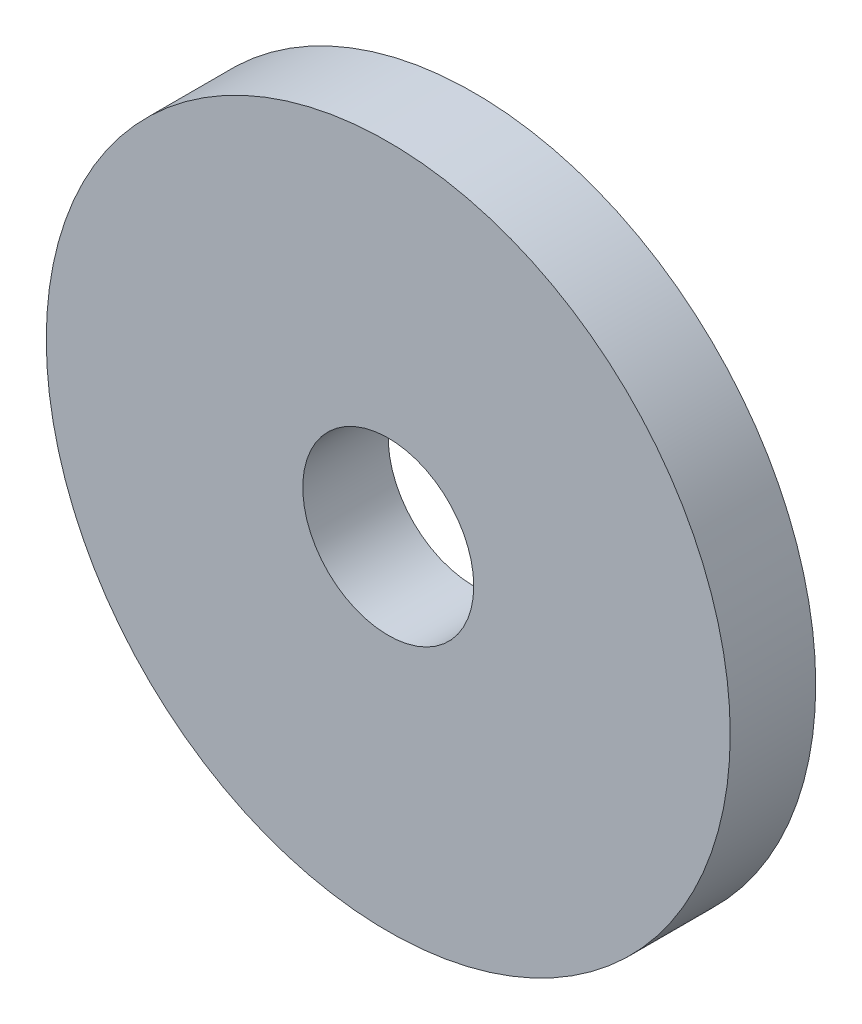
from build123d import *

# Parameters (mm, degrees)
SKETCH1_R           = 12.7
SKETCH1_R_2         = 3.175
BOSS_EXTRUDE1_DEPTH = 3.175


with BuildPart() as part:
    # Sketch1 → Boss-Extrude1 (new body)
    with BuildSketch(Plane.XY):
        Circle(SKETCH1_R)
        Circle(SKETCH1_R_2, mode=Mode.SUBTRACT)
    extrude(amount=BOSS_EXTRUDE1_DEPTH)


solid = part.part
